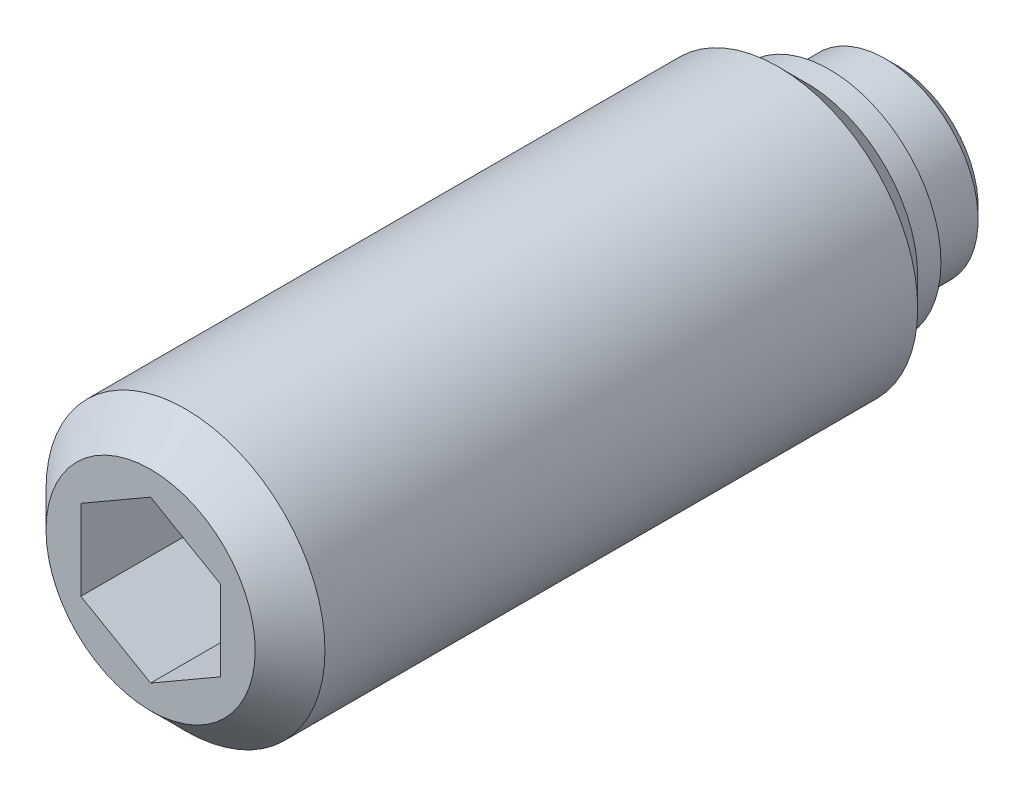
ISO-10303-21;
HEADER;
FILE_DESCRIPTION(('STEP AP214'),'2;1');
FILE_NAME('part.step','',(''),(''),'','','');
FILE_SCHEMA(('AUTOMOTIVE_DESIGN { 1 0 10303 214 1 1 1 1 }'));
ENDSEC;
DATA;
#1=APPLICATION_CONTEXT('core data for automotive mechanical design processes');
#2=APPLICATION_PROTOCOL_DEFINITION('international standard','automotive_design',2000,#1);
#3=PRODUCT_CONTEXT('',#1,'mechanical');
#4=PRODUCT('Part','Part','',(#3));
#5=PRODUCT_RELATED_PRODUCT_CATEGORY('part','',(#4));
#6=PRODUCT_DEFINITION_FORMATION('','',#4);
#7=PRODUCT_DEFINITION_CONTEXT('part definition',#1,'design');
#8=PRODUCT_DEFINITION('design','',#6,#7);
#9=PRODUCT_DEFINITION_SHAPE('','',#8);
#10=(LENGTH_UNIT() NAMED_UNIT(*) SI_UNIT(.MILLI.,.METRE.));
#11=(NAMED_UNIT(*) PLANE_ANGLE_UNIT() SI_UNIT($,.RADIAN.));
#12=(NAMED_UNIT(*) SI_UNIT($,.STERADIAN.) SOLID_ANGLE_UNIT());
#13=UNCERTAINTY_MEASURE_WITH_UNIT(LENGTH_MEASURE(1.E-05),#10,'distance_accuracy_value','');
#14=(GEOMETRIC_REPRESENTATION_CONTEXT(3) GLOBAL_UNCERTAINTY_ASSIGNED_CONTEXT((#13)) GLOBAL_UNIT_ASSIGNED_CONTEXT((#10,
#11,#12)) REPRESENTATION_CONTEXT('',''));
#15=CARTESIAN_POINT('',(0.,0.,0.));
#16=DIRECTION('',(0.,0.,1.));
#17=DIRECTION('',(1.,0.,0.));
#18=AXIS2_PLACEMENT_3D('',#15,#16,#17);
#19=CARTESIAN_POINT('',(0.,0.,2.9));
#20=DIRECTION('',(0.,0.,-1.));
#21=DIRECTION('',(-1.,0.,0.));
#22=AXIS2_PLACEMENT_3D('',#19,#20,#21);
#23=CYLINDRICAL_SURFACE('',#22,6.);
#24=CARTESIAN_POINT('',(0.,0.,30.6));
#25=DIRECTION('',(0.,0.,1.));
#26=DIRECTION('',(1.,0.,0.));
#27=AXIS2_PLACEMENT_3D('',#24,#25,#26);
#28=CIRCLE('',#27,6.);
#29=CARTESIAN_POINT('',(6.,0.,30.6));
#30=VERTEX_POINT('',#29);
#31=EDGE_CURVE('E9',#30,#30,#28,.F.);
#32=ORIENTED_EDGE('',*,*,#31,.T.);
#33=EDGE_LOOP('',(#32));
#34=FACE_BOUND('',#33,.T.);
#35=CARTESIAN_POINT('',(0.,0.,5.1));
#36=DIRECTION('',(0.,0.,-1.));
#37=DIRECTION('',(-1.,0.,0.));
#38=AXIS2_PLACEMENT_3D('',#35,#36,#37);
#39=CIRCLE('',#38,6.);
#40=CARTESIAN_POINT('',(-6.,0.,5.1));
#41=VERTEX_POINT('',#40);
#42=EDGE_CURVE('E74',#41,#41,#39,.T.);
#43=ORIENTED_EDGE('',*,*,#42,.F.);
#44=EDGE_LOOP('',(#43));
#45=FACE_BOUND('',#44,.T.);
#46=ADVANCED_FACE('F14',(#34,#45),#23,.T.);
#47=CARTESIAN_POINT('',(0.,0.,0.));
#48=DIRECTION('',(0.,0.,-1.));
#49=DIRECTION('',(-1.,0.,0.));
#50=AXIS2_PLACEMENT_3D('',#47,#48,#49);
#51=CYLINDRICAL_SURFACE('',#50,4.);
#52=CARTESIAN_POINT('',(0.,0.,0.5));
#53=DIRECTION('',(0.,0.,-1.));
#54=DIRECTION('',(-1.,0.,0.));
#55=AXIS2_PLACEMENT_3D('',#52,#53,#54);
#56=CIRCLE('',#55,4.);
#57=CARTESIAN_POINT('',(-4.,0.,0.5));
#58=VERTEX_POINT('',#57);
#59=EDGE_CURVE('E106',#58,#58,#56,.T.);
#60=ORIENTED_EDGE('',*,*,#59,.F.);
#61=EDGE_LOOP('',(#60));
#62=FACE_BOUND('',#61,.T.);
#63=CARTESIAN_POINT('',(0.,0.,2.9));
#64=DIRECTION('',(0.,0.,-1.));
#65=DIRECTION('',(-1.,0.,0.));
#66=AXIS2_PLACEMENT_3D('',#63,#64,#65);
#67=CIRCLE('',#66,4.);
#68=CARTESIAN_POINT('',(-4.,0.,2.9));
#69=VERTEX_POINT('',#68);
#70=EDGE_CURVE('E100',#69,#69,#67,.T.);
#71=ORIENTED_EDGE('',*,*,#70,.T.);
#72=EDGE_LOOP('',(#71));
#73=FACE_BOUND('',#72,.T.);
#74=ADVANCED_FACE('F130',(#62,#73),#51,.T.);
#75=CARTESIAN_POINT('',(0.,0.,0.5));
#76=DIRECTION('',(0.,0.,1.));
#77=DIRECTION('',(1.,0.,0.));
#78=AXIS2_PLACEMENT_3D('',#75,#76,#77);
#79=CONICAL_SURFACE('',#78,4.,0.785398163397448);
#80=CARTESIAN_POINT('',(0.,0.,0.));
#81=DIRECTION('',(0.,0.,-1.));
#82=DIRECTION('',(-1.,0.,0.));
#83=AXIS2_PLACEMENT_3D('',#80,#81,#82);
#84=CIRCLE('',#83,3.5);
#85=CARTESIAN_POINT('',(-3.5,0.,0.));
#86=VERTEX_POINT('',#85);
#87=EDGE_CURVE('E103',#86,#86,#84,.T.);
#88=ORIENTED_EDGE('',*,*,#87,.F.);
#89=EDGE_LOOP('',(#88));
#90=FACE_BOUND('',#89,.T.);
#91=ORIENTED_EDGE('',*,*,#59,.T.);
#92=EDGE_LOOP('',(#91));
#93=FACE_BOUND('',#92,.T.);
#94=ADVANCED_FACE('F135',(#90,#93),#79,.T.);
#95=CARTESIAN_POINT('',(0.,3.5,0.));
#96=DIRECTION('',(0.,0.,1.));
#97=DIRECTION('',(1.,0.,0.));
#98=AXIS2_PLACEMENT_3D('',#95,#96,#97);
#99=PLANE('',#98);
#100=ORIENTED_EDGE('',*,*,#87,.T.);
#101=EDGE_LOOP('',(#100));
#102=FACE_BOUND('',#101,.T.);
#103=ADVANCED_FACE('F150',(#102),#99,.F.);
#104=CARTESIAN_POINT('',(0.,4.8,2.9));
#105=DIRECTION('',(0.,0.,1.));
#106=DIRECTION('',(1.,0.,0.));
#107=AXIS2_PLACEMENT_3D('',#104,#105,#106);
#108=PLANE('',#107);
#109=CARTESIAN_POINT('',(0.,0.,2.9));
#110=DIRECTION('',(0.,0.,-1.));
#111=DIRECTION('',(-1.,0.,0.));
#112=AXIS2_PLACEMENT_3D('',#109,#110,#111);
#113=CIRCLE('',#112,4.8);
#114=CARTESIAN_POINT('',(-4.8,0.,2.9));
#115=VERTEX_POINT('',#114);
#116=EDGE_CURVE('E109',#115,#115,#113,.T.);
#117=ORIENTED_EDGE('',*,*,#116,.T.);
#118=EDGE_LOOP('',(#117));
#119=FACE_BOUND('',#118,.T.);
#120=ORIENTED_EDGE('',*,*,#70,.F.);
#121=EDGE_LOOP('',(#120));
#122=FACE_BOUND('',#121,.T.);
#123=ADVANCED_FACE('F147',(#119,#122),#108,.F.);
#124=CARTESIAN_POINT('',(0.,0.,2.9));
#125=DIRECTION('',(0.,0.,-1.));
#126=DIRECTION('',(-1.,0.,0.));
#127=AXIS2_PLACEMENT_3D('',#124,#125,#126);
#128=CYLINDRICAL_SURFACE('',#127,4.8);
#129=CARTESIAN_POINT('',(0.,0.,3.9));
#130=DIRECTION('',(0.,0.,-1.));
#131=DIRECTION('',(-1.,0.,0.));
#132=AXIS2_PLACEMENT_3D('',#129,#130,#131);
#133=CIRCLE('',#132,4.8);
#134=CARTESIAN_POINT('',(-4.8,0.,3.9));
#135=VERTEX_POINT('',#134);
#136=EDGE_CURVE('E112',#135,#135,#133,.T.);
#137=ORIENTED_EDGE('',*,*,#136,.T.);
#138=EDGE_LOOP('',(#137));
#139=FACE_BOUND('',#138,.T.);
#140=ORIENTED_EDGE('',*,*,#116,.F.);
#141=EDGE_LOOP('',(#140));
#142=FACE_BOUND('',#141,.T.);
#143=ADVANCED_FACE('F143',(#139,#142),#128,.T.);
#144=CARTESIAN_POINT('',(0.,0.,5.1));
#145=DIRECTION('',(0.,0.,1.));
#146=DIRECTION('',(1.,0.,0.));
#147=AXIS2_PLACEMENT_3D('',#144,#145,#146);
#148=CONICAL_SURFACE('',#147,6.,0.785398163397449);
#149=ORIENTED_EDGE('',*,*,#42,.T.);
#150=EDGE_LOOP('',(#149));
#151=FACE_BOUND('',#150,.T.);
#152=ORIENTED_EDGE('',*,*,#136,.F.);
#153=EDGE_LOOP('',(#152));
#154=FACE_BOUND('',#153,.T.);
#155=ADVANCED_FACE('F140',(#151,#154),#148,.T.);
#156=CARTESIAN_POINT('',(0.,0.,32.1));
#157=DIRECTION('',(0.,0.,1.));
#158=DIRECTION('',(1.,0.,0.));
#159=AXIS2_PLACEMENT_3D('',#156,#157,#158);
#160=PLANE('',#159);
#161=CARTESIAN_POINT('',(0.,0.,32.1));
#162=DIRECTION('',(0.,0.,1.));
#163=DIRECTION('',(1.,0.,0.));
#164=AXIS2_PLACEMENT_3D('',#161,#162,#163);
#165=CIRCLE('',#164,4.5);
#166=CARTESIAN_POINT('',(4.5,0.,32.1));
#167=VERTEX_POINT('',#166);
#168=EDGE_CURVE('E22',#167,#167,#165,.T.);
#169=ORIENTED_EDGE('',*,*,#168,.T.);
#170=EDGE_LOOP('',(#169));
#171=FACE_BOUND('',#170,.T.);
#172=DIRECTION('',(-0.866025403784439,0.5,0.));
#173=VECTOR('',#172,1.);
#174=CARTESIAN_POINT('',(-3.,-1.73205080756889,32.1));
#175=LINE('',#174,#173);
#176=CARTESIAN_POINT('',(0.,-3.46410161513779,32.1));
#177=VERTEX_POINT('',#176);
#178=CARTESIAN_POINT('',(-3.,-1.73205080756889,32.1));
#179=VERTEX_POINT('',#178);
#180=EDGE_CURVE('E69',#177,#179,#175,.T.);
#181=ORIENTED_EDGE('',*,*,#180,.T.);
#182=DIRECTION('',(0.,1.,0.));
#183=VECTOR('',#182,1.);
#184=CARTESIAN_POINT('',(-3.,1.73205080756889,32.1));
#185=LINE('',#184,#183);
#186=CARTESIAN_POINT('',(-3.,1.73205080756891,32.1));
#187=VERTEX_POINT('',#186);
#188=EDGE_CURVE('E84',#179,#187,#185,.T.);
#189=ORIENTED_EDGE('',*,*,#188,.T.);
#190=DIRECTION('',(0.866025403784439,0.5,0.));
#191=VECTOR('',#190,1.);
#192=CARTESIAN_POINT('',(0.,3.46410161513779,32.1));
#193=LINE('',#192,#191);
#194=CARTESIAN_POINT('',(0.,3.46410161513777,32.1));
#195=VERTEX_POINT('',#194);
#196=EDGE_CURVE('E301',#187,#195,#193,.T.);
#197=ORIENTED_EDGE('',*,*,#196,.T.);
#198=DIRECTION('',(0.866025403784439,-0.5,0.));
#199=VECTOR('',#198,1.);
#200=CARTESIAN_POINT('',(3.,1.73205080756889,32.1));
#201=LINE('',#200,#199);
#202=CARTESIAN_POINT('',(3.,1.73205080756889,32.1));
#203=VERTEX_POINT('',#202);
#204=EDGE_CURVE('E298',#195,#203,#201,.T.);
#205=ORIENTED_EDGE('',*,*,#204,.T.);
#206=DIRECTION('',(0.,-1.,0.));
#207=VECTOR('',#206,1.);
#208=CARTESIAN_POINT('',(3.,-1.73205080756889,32.1));
#209=LINE('',#208,#207);
#210=CARTESIAN_POINT('',(3.,-1.73205080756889,32.1));
#211=VERTEX_POINT('',#210);
#212=EDGE_CURVE('E29',#203,#211,#209,.T.);
#213=ORIENTED_EDGE('',*,*,#212,.T.);
#214=DIRECTION('',(-0.866025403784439,-0.5,0.));
#215=VECTOR('',#214,1.);
#216=CARTESIAN_POINT('',(0.,-3.46410161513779,32.1));
#217=LINE('',#216,#215);
#218=EDGE_CURVE('E66',#211,#177,#217,.T.);
#219=ORIENTED_EDGE('',*,*,#218,.T.);
#220=EDGE_LOOP('',(#181,#189,#197,#205,#213,#219));
#221=FACE_BOUND('',#220,.T.);
#222=ADVANCED_FACE('F68',(#171,#221),#160,.T.);
#223=CARTESIAN_POINT('',(0.,0.,24.1));
#224=DIRECTION('',(0.,0.,1.));
#225=DIRECTION('',(1.,0.,0.));
#226=AXIS2_PLACEMENT_3D('',#223,#224,#225);
#227=PLANE('',#226);
#228=DIRECTION('',(0.,-1.,0.));
#229=VECTOR('',#228,1.);
#230=CARTESIAN_POINT('',(-3.,1.73205080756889,24.1));
#231=LINE('',#230,#229);
#232=CARTESIAN_POINT('',(-3.,1.73205080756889,24.1));
#233=VERTEX_POINT('',#232);
#234=CARTESIAN_POINT('',(-3.,-1.73205080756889,24.1));
#235=VERTEX_POINT('',#234);
#236=EDGE_CURVE('E83',#233,#235,#231,.T.);
#237=ORIENTED_EDGE('',*,*,#236,.T.);
#238=DIRECTION('',(0.866025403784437,-0.5,0.));
#239=VECTOR('',#238,1.);
#240=CARTESIAN_POINT('',(-3.,-1.73205080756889,24.1));
#241=LINE('',#240,#239);
#242=CARTESIAN_POINT('',(0.,-3.46410161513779,24.1));
#243=VERTEX_POINT('',#242);
#244=EDGE_CURVE('E280',#235,#243,#241,.T.);
#245=ORIENTED_EDGE('',*,*,#244,.T.);
#246=DIRECTION('',(0.866025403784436,0.5,0.));
#247=VECTOR('',#246,1.);
#248=CARTESIAN_POINT('',(0.,-3.46410161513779,24.1));
#249=LINE('',#248,#247);
#250=CARTESIAN_POINT('',(3.,-1.73205080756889,24.1));
#251=VERTEX_POINT('',#250);
#252=EDGE_CURVE('E88',#243,#251,#249,.T.);
#253=ORIENTED_EDGE('',*,*,#252,.T.);
#254=DIRECTION('',(0.,1.,0.));
#255=VECTOR('',#254,1.);
#256=CARTESIAN_POINT('',(3.,-1.73205080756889,24.1));
#257=LINE('',#256,#255);
#258=CARTESIAN_POINT('',(3.,1.73205080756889,24.1));
#259=VERTEX_POINT('',#258);
#260=EDGE_CURVE('E287',#251,#259,#257,.T.);
#261=ORIENTED_EDGE('',*,*,#260,.T.);
#262=DIRECTION('',(-0.866025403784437,0.5,0.));
#263=VECTOR('',#262,1.);
#264=CARTESIAN_POINT('',(3.,1.73205080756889,24.1));
#265=LINE('',#264,#263);
#266=CARTESIAN_POINT('',(0.,3.46410161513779,24.1));
#267=VERTEX_POINT('',#266);
#268=EDGE_CURVE('E96',#259,#267,#265,.T.);
#269=ORIENTED_EDGE('',*,*,#268,.T.);
#270=DIRECTION('',(-0.866025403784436,-0.5,0.));
#271=VECTOR('',#270,1.);
#272=CARTESIAN_POINT('',(0.,3.46410161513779,24.1));
#273=LINE('',#272,#271);
#274=EDGE_CURVE('E91',#267,#233,#273,.T.);
#275=ORIENTED_EDGE('',*,*,#274,.T.);
#276=EDGE_LOOP('',(#237,#245,#253,#261,#269,#275));
#277=FACE_BOUND('',#276,.T.);
#278=ADVANCED_FACE('F162',(#277),#227,.T.);
#279=CARTESIAN_POINT('',(0.,-3.46410161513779,34.1));
#280=DIRECTION('',(0.5,-0.866025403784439,0.));
#281=DIRECTION('',(0.866025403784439,0.5,0.));
#282=AXIS2_PLACEMENT_3D('',#279,#280,#281);
#283=PLANE('',#282);
#284=ORIENTED_EDGE('',*,*,#218,.F.);
#285=DIRECTION('',(0.,0.,1.));
#286=VECTOR('',#285,1.);
#287=CARTESIAN_POINT('',(3.,-1.73205080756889,34.1));
#288=LINE('',#287,#286);
#289=EDGE_CURVE('E90',#251,#211,#288,.T.);
#290=ORIENTED_EDGE('',*,*,#289,.F.);
#291=ORIENTED_EDGE('',*,*,#252,.F.);
#292=DIRECTION('',(0.,0.,1.));
#293=VECTOR('',#292,1.);
#294=CARTESIAN_POINT('',(0.,-3.46410161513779,34.1));
#295=LINE('',#294,#293);
#296=EDGE_CURVE('E80',#243,#177,#295,.T.);
#297=ORIENTED_EDGE('',*,*,#296,.T.);
#298=EDGE_LOOP('',(#284,#290,#291,#297));
#299=FACE_BOUND('',#298,.T.);
#300=ADVANCED_FACE('F86',(#299),#283,.F.);
#301=CARTESIAN_POINT('',(3.,-1.73205080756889,34.1));
#302=DIRECTION('',(1.,0.,0.));
#303=DIRECTION('',(0.,0.,-1.));
#304=AXIS2_PLACEMENT_3D('',#301,#302,#303);
#305=PLANE('',#304);
#306=ORIENTED_EDGE('',*,*,#212,.F.);
#307=DIRECTION('',(0.,0.,1.));
#308=VECTOR('',#307,1.);
#309=CARTESIAN_POINT('',(3.,1.73205080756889,34.1));
#310=LINE('',#309,#308);
#311=EDGE_CURVE('E93',#259,#203,#310,.T.);
#312=ORIENTED_EDGE('',*,*,#311,.F.);
#313=ORIENTED_EDGE('',*,*,#260,.F.);
#314=ORIENTED_EDGE('',*,*,#289,.T.);
#315=EDGE_LOOP('',(#306,#312,#313,#314));
#316=FACE_BOUND('',#315,.T.);
#317=ADVANCED_FACE('F161',(#316),#305,.F.);
#318=CARTESIAN_POINT('',(3.,1.73205080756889,34.1));
#319=DIRECTION('',(0.5,0.866025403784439,0.));
#320=DIRECTION('',(-0.866025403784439,0.5,0.));
#321=AXIS2_PLACEMENT_3D('',#318,#319,#320);
#322=PLANE('',#321);
#323=ORIENTED_EDGE('',*,*,#204,.F.);
#324=DIRECTION('',(0.,0.,1.));
#325=VECTOR('',#324,1.);
#326=CARTESIAN_POINT('',(0.,3.46410161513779,34.1));
#327=LINE('',#326,#325);
#328=EDGE_CURVE('E293',#267,#195,#327,.T.);
#329=ORIENTED_EDGE('',*,*,#328,.F.);
#330=ORIENTED_EDGE('',*,*,#268,.F.);
#331=ORIENTED_EDGE('',*,*,#311,.T.);
#332=EDGE_LOOP('',(#323,#329,#330,#331));
#333=FACE_BOUND('',#332,.T.);
#334=ADVANCED_FACE('F165',(#333),#322,.F.);
#335=CARTESIAN_POINT('',(0.,3.46410161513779,34.1));
#336=DIRECTION('',(-0.5,0.866025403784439,0.));
#337=DIRECTION('',(-0.866025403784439,-0.5,0.));
#338=AXIS2_PLACEMENT_3D('',#335,#336,#337);
#339=PLANE('',#338);
#340=ORIENTED_EDGE('',*,*,#196,.F.);
#341=DIRECTION('',(0.,0.,1.));
#342=VECTOR('',#341,1.);
#343=CARTESIAN_POINT('',(-3.,1.73205080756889,34.1));
#344=LINE('',#343,#342);
#345=EDGE_CURVE('E37',#233,#187,#344,.T.);
#346=ORIENTED_EDGE('',*,*,#345,.F.);
#347=ORIENTED_EDGE('',*,*,#274,.F.);
#348=ORIENTED_EDGE('',*,*,#328,.T.);
#349=EDGE_LOOP('',(#340,#346,#347,#348));
#350=FACE_BOUND('',#349,.T.);
#351=ADVANCED_FACE('F169',(#350),#339,.F.);
#352=CARTESIAN_POINT('',(-3.,1.73205080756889,34.1));
#353=DIRECTION('',(-1.,0.,0.));
#354=DIRECTION('',(0.,0.,1.));
#355=AXIS2_PLACEMENT_3D('',#352,#353,#354);
#356=PLANE('',#355);
#357=ORIENTED_EDGE('',*,*,#188,.F.);
#358=DIRECTION('',(0.,0.,1.));
#359=VECTOR('',#358,1.);
#360=CARTESIAN_POINT('',(-3.,-1.73205080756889,34.1));
#361=LINE('',#360,#359);
#362=EDGE_CURVE('E82',#235,#179,#361,.T.);
#363=ORIENTED_EDGE('',*,*,#362,.F.);
#364=ORIENTED_EDGE('',*,*,#236,.F.);
#365=ORIENTED_EDGE('',*,*,#345,.T.);
#366=EDGE_LOOP('',(#357,#363,#364,#365));
#367=FACE_BOUND('',#366,.T.);
#368=ADVANCED_FACE('F126',(#367),#356,.F.);
#369=CARTESIAN_POINT('',(-3.,-1.73205080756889,34.1));
#370=DIRECTION('',(-0.5,-0.866025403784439,0.));
#371=DIRECTION('',(0.866025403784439,-0.5,0.));
#372=AXIS2_PLACEMENT_3D('',#369,#370,#371);
#373=PLANE('',#372);
#374=ORIENTED_EDGE('',*,*,#180,.F.);
#375=ORIENTED_EDGE('',*,*,#296,.F.);
#376=ORIENTED_EDGE('',*,*,#244,.F.);
#377=ORIENTED_EDGE('',*,*,#362,.T.);
#378=EDGE_LOOP('',(#374,#375,#376,#377));
#379=FACE_BOUND('',#378,.T.);
#380=ADVANCED_FACE('F78',(#379),#373,.F.);
#381=CARTESIAN_POINT('',(0.,0.,32.1));
#382=DIRECTION('',(0.,0.,-1.));
#383=DIRECTION('',(-1.,0.,0.));
#384=AXIS2_PLACEMENT_3D('',#381,#382,#383);
#385=CONICAL_SURFACE('',#384,4.5,0.785398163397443);
#386=ORIENTED_EDGE('',*,*,#31,.F.);
#387=EDGE_LOOP('',(#386));
#388=FACE_BOUND('',#387,.T.);
#389=ORIENTED_EDGE('',*,*,#168,.F.);
#390=EDGE_LOOP('',(#389));
#391=FACE_BOUND('',#390,.T.);
#392=ADVANCED_FACE('F16',(#388,#391),#385,.T.);
#393=CLOSED_SHELL('',(#46,#74,#94,#103,#123,#143,#155,#222,#278,#300,#317,#334,#351,#368,#380,#392));
#394=MANIFOLD_SOLID_BREP('B1',#393);
#395=ADVANCED_BREP_SHAPE_REPRESENTATION('',(#18,#394),#14);
#396=SHAPE_DEFINITION_REPRESENTATION(#9,#395);
ENDSEC;
END-ISO-10303-21;
